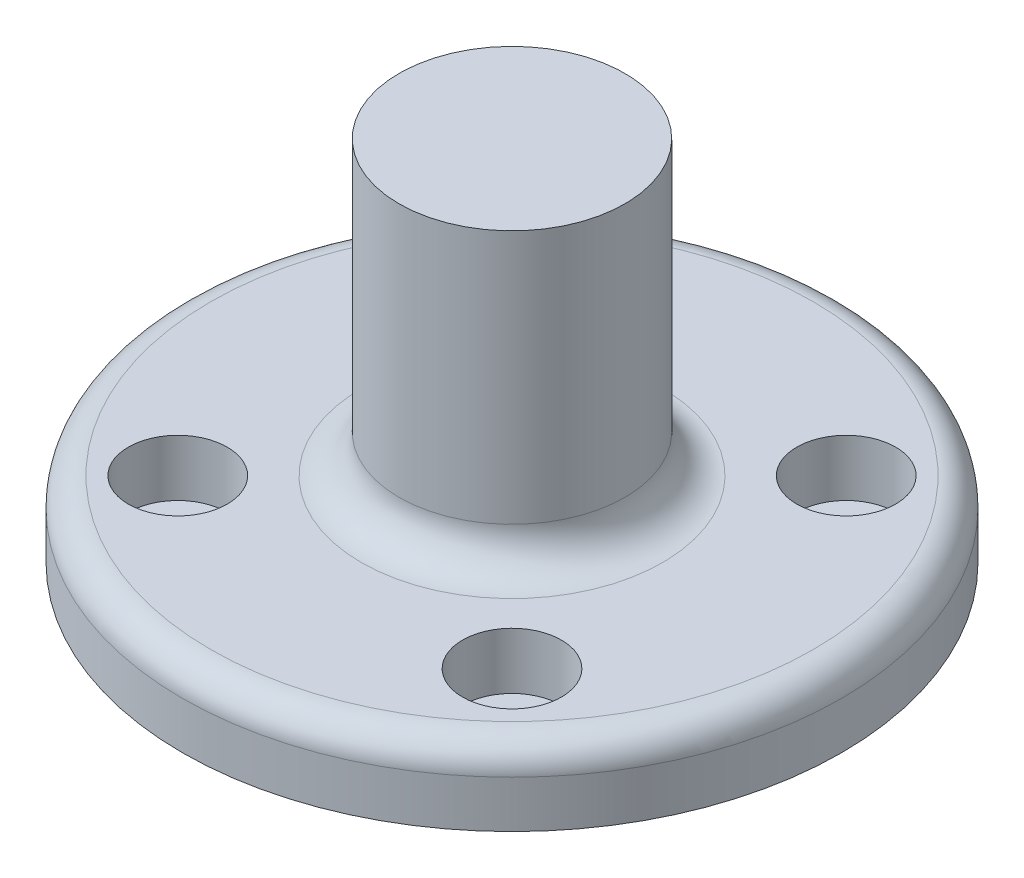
ISO-10303-21;
HEADER;
FILE_DESCRIPTION(('STEP AP214'),'2;1');
FILE_NAME('part.step','',(''),(''),'','','');
FILE_SCHEMA(('AUTOMOTIVE_DESIGN { 1 0 10303 214 1 1 1 1 }'));
ENDSEC;
DATA;
#1=APPLICATION_CONTEXT('core data for automotive mechanical design processes');
#2=APPLICATION_PROTOCOL_DEFINITION('international standard','automotive_design',2000,#1);
#3=PRODUCT_CONTEXT('',#1,'mechanical');
#4=PRODUCT('Part','Part','',(#3));
#5=PRODUCT_RELATED_PRODUCT_CATEGORY('part','',(#4));
#6=PRODUCT_DEFINITION_FORMATION('','',#4);
#7=PRODUCT_DEFINITION_CONTEXT('part definition',#1,'design');
#8=PRODUCT_DEFINITION('design','',#6,#7);
#9=PRODUCT_DEFINITION_SHAPE('','',#8);
#10=(LENGTH_UNIT() NAMED_UNIT(*) SI_UNIT(.MILLI.,.METRE.));
#11=(NAMED_UNIT(*) PLANE_ANGLE_UNIT() SI_UNIT($,.RADIAN.));
#12=(NAMED_UNIT(*) SI_UNIT($,.STERADIAN.) SOLID_ANGLE_UNIT());
#13=UNCERTAINTY_MEASURE_WITH_UNIT(LENGTH_MEASURE(1.E-05),#10,'distance_accuracy_value','');
#14=(GEOMETRIC_REPRESENTATION_CONTEXT(3) GLOBAL_UNCERTAINTY_ASSIGNED_CONTEXT((#13)) GLOBAL_UNIT_ASSIGNED_CONTEXT((#10,
#11,#12)) REPRESENTATION_CONTEXT('',''));
#15=CARTESIAN_POINT('',(0.,0.,0.));
#16=DIRECTION('',(0.,0.,1.));
#17=DIRECTION('',(1.,0.,0.));
#18=AXIS2_PLACEMENT_3D('',#15,#16,#17);
#19=CARTESIAN_POINT('',(0.,8.,0.));
#20=DIRECTION('',(0.,-1.,0.));
#21=DIRECTION('',(0.,0.,-1.));
#22=AXIS2_PLACEMENT_3D('',#19,#20,#21);
#23=CYLINDRICAL_SURFACE('',#22,35.);
#24=CARTESIAN_POINT('',(0.,5.,0.));
#25=DIRECTION('',(0.,1.,0.));
#26=DIRECTION('',(0.,0.,1.));
#27=AXIS2_PLACEMENT_3D('',#24,#25,#26);
#28=CIRCLE('',#27,35.);
#29=CARTESIAN_POINT('',(0.,5.,35.));
#30=VERTEX_POINT('',#29);
#31=EDGE_CURVE('E41',#30,#30,#28,.F.);
#32=ORIENTED_EDGE('',*,*,#31,.T.);
#33=EDGE_LOOP('',(#32));
#34=FACE_BOUND('',#33,.T.);
#35=CARTESIAN_POINT('',(0.,0.,0.));
#36=DIRECTION('',(0.,1.,0.));
#37=DIRECTION('',(0.,0.,1.));
#38=AXIS2_PLACEMENT_3D('',#35,#36,#37);
#39=CIRCLE('',#38,35.);
#40=CARTESIAN_POINT('',(0.,0.,35.));
#41=VERTEX_POINT('',#40);
#42=EDGE_CURVE('E50',#41,#41,#39,.T.);
#43=ORIENTED_EDGE('',*,*,#42,.T.);
#44=EDGE_LOOP('',(#43));
#45=FACE_BOUND('',#44,.T.);
#46=ADVANCED_FACE('F30',(#34,#45),#23,.T.);
#47=CARTESIAN_POINT('',(0.,8.,0.));
#48=DIRECTION('',(0.,1.,0.));
#49=DIRECTION('',(0.,0.,1.));
#50=AXIS2_PLACEMENT_3D('',#47,#48,#49);
#51=PLANE('',#50);
#52=CARTESIAN_POINT('',(0.,8.,0.));
#53=DIRECTION('',(0.,1.,0.));
#54=DIRECTION('',(0.,0.,1.));
#55=AXIS2_PLACEMENT_3D('',#52,#53,#54);
#56=CIRCLE('',#55,16.);
#57=CARTESIAN_POINT('',(0.,8.,16.));
#58=VERTEX_POINT('',#57);
#59=EDGE_CURVE('E10',#58,#58,#56,.F.);
#60=ORIENTED_EDGE('',*,*,#59,.T.);
#61=EDGE_LOOP('',(#60));
#62=FACE_BOUND('',#61,.T.);
#63=CARTESIAN_POINT('',(0.,8.,0.));
#64=DIRECTION('',(0.,1.,0.));
#65=DIRECTION('',(0.,0.,1.));
#66=AXIS2_PLACEMENT_3D('',#63,#64,#65);
#67=CIRCLE('',#66,32.);
#68=CARTESIAN_POINT('',(0.,8.,32.));
#69=VERTEX_POINT('',#68);
#70=EDGE_CURVE('E45',#69,#69,#67,.T.);
#71=ORIENTED_EDGE('',*,*,#70,.T.);
#72=EDGE_LOOP('',(#71));
#73=FACE_BOUND('',#72,.T.);
#74=CARTESIAN_POINT('',(-17.75,8.,17.75));
#75=DIRECTION('',(0.,1.,0.));
#76=DIRECTION('',(0.,0.,1.));
#77=AXIS2_PLACEMENT_3D('',#74,#75,#76);
#78=CIRCLE('',#77,5.25);
#79=CARTESIAN_POINT('',(-17.75,8.,23.));
#80=VERTEX_POINT('',#79);
#81=EDGE_CURVE('E72',#80,#80,#78,.T.);
#82=ORIENTED_EDGE('',*,*,#81,.F.);
#83=EDGE_LOOP('',(#82));
#84=FACE_BOUND('',#83,.T.);
#85=CARTESIAN_POINT('',(17.75,8.,17.75));
#86=DIRECTION('',(0.,1.,0.));
#87=DIRECTION('',(0.,0.,1.));
#88=AXIS2_PLACEMENT_3D('',#85,#86,#87);
#89=CIRCLE('',#88,5.25);
#90=CARTESIAN_POINT('',(17.75,8.,23.));
#91=VERTEX_POINT('',#90);
#92=EDGE_CURVE('E66',#91,#91,#89,.T.);
#93=ORIENTED_EDGE('',*,*,#92,.F.);
#94=EDGE_LOOP('',(#93));
#95=FACE_BOUND('',#94,.T.);
#96=CARTESIAN_POINT('',(17.75,8.,-17.75));
#97=DIRECTION('',(0.,1.,0.));
#98=DIRECTION('',(0.,0.,1.));
#99=AXIS2_PLACEMENT_3D('',#96,#97,#98);
#100=CIRCLE('',#99,5.25);
#101=CARTESIAN_POINT('',(17.75,8.,-12.5));
#102=VERTEX_POINT('',#101);
#103=EDGE_CURVE('E60',#102,#102,#100,.T.);
#104=ORIENTED_EDGE('',*,*,#103,.F.);
#105=EDGE_LOOP('',(#104));
#106=FACE_BOUND('',#105,.T.);
#107=CARTESIAN_POINT('',(-17.75,8.,-17.75));
#108=DIRECTION('',(0.,1.,0.));
#109=DIRECTION('',(0.,0.,1.));
#110=AXIS2_PLACEMENT_3D('',#107,#108,#109);
#111=CIRCLE('',#110,5.25);
#112=CARTESIAN_POINT('',(-17.75,8.,-12.5));
#113=VERTEX_POINT('',#112);
#114=EDGE_CURVE('E54',#113,#113,#111,.T.);
#115=ORIENTED_EDGE('',*,*,#114,.F.);
#116=EDGE_LOOP('',(#115));
#117=FACE_BOUND('',#116,.T.);
#118=ADVANCED_FACE('F121',(#62,#73,#84,#95,#106,#117),#51,.T.);
#119=CARTESIAN_POINT('',(0.,0.,0.));
#120=DIRECTION('',(0.,1.,0.));
#121=DIRECTION('',(0.,0.,1.));
#122=AXIS2_PLACEMENT_3D('',#119,#120,#121);
#123=PLANE('',#122);
#124=CARTESIAN_POINT('',(17.75,0.,17.75));
#125=DIRECTION('',(0.,1.,0.));
#126=DIRECTION('',(0.,0.,1.));
#127=AXIS2_PLACEMENT_3D('',#124,#125,#126);
#128=CIRCLE('',#127,3.25);
#129=CARTESIAN_POINT('',(17.75,0.,21.));
#130=VERTEX_POINT('',#129);
#131=EDGE_CURVE('E93',#130,#130,#128,.T.);
#132=ORIENTED_EDGE('',*,*,#131,.T.);
#133=EDGE_LOOP('',(#132));
#134=FACE_BOUND('',#133,.T.);
#135=CARTESIAN_POINT('',(-17.75,0.,17.75));
#136=DIRECTION('',(0.,1.,0.));
#137=DIRECTION('',(0.,0.,1.));
#138=AXIS2_PLACEMENT_3D('',#135,#136,#137);
#139=CIRCLE('',#138,3.25);
#140=CARTESIAN_POINT('',(-17.75,0.,21.));
#141=VERTEX_POINT('',#140);
#142=EDGE_CURVE('E87',#141,#141,#139,.T.);
#143=ORIENTED_EDGE('',*,*,#142,.T.);
#144=EDGE_LOOP('',(#143));
#145=FACE_BOUND('',#144,.T.);
#146=CARTESIAN_POINT('',(-17.75,0.,-17.75));
#147=DIRECTION('',(0.,1.,0.));
#148=DIRECTION('',(0.,0.,1.));
#149=AXIS2_PLACEMENT_3D('',#146,#147,#148);
#150=CIRCLE('',#149,3.25);
#151=CARTESIAN_POINT('',(-17.75,0.,-14.5));
#152=VERTEX_POINT('',#151);
#153=EDGE_CURVE('E81',#152,#152,#150,.T.);
#154=ORIENTED_EDGE('',*,*,#153,.T.);
#155=EDGE_LOOP('',(#154));
#156=FACE_BOUND('',#155,.T.);
#157=CARTESIAN_POINT('',(17.75,0.,-17.75));
#158=DIRECTION('',(0.,1.,0.));
#159=DIRECTION('',(0.,0.,1.));
#160=AXIS2_PLACEMENT_3D('',#157,#158,#159);
#161=CIRCLE('',#160,3.25);
#162=CARTESIAN_POINT('',(17.75,0.,-14.5));
#163=VERTEX_POINT('',#162);
#164=EDGE_CURVE('E75',#163,#163,#161,.T.);
#165=ORIENTED_EDGE('',*,*,#164,.T.);
#166=EDGE_LOOP('',(#165));
#167=FACE_BOUND('',#166,.T.);
#168=ORIENTED_EDGE('',*,*,#42,.F.);
#169=EDGE_LOOP('',(#168));
#170=FACE_BOUND('',#169,.T.);
#171=ADVANCED_FACE('F127',(#134,#145,#156,#167,#170),#123,.F.);
#172=CARTESIAN_POINT('',(-17.75,2.,-17.75));
#173=DIRECTION('',(0.,1.,0.));
#174=DIRECTION('',(0.,0.,1.));
#175=AXIS2_PLACEMENT_3D('',#172,#173,#174);
#176=CYLINDRICAL_SURFACE('',#175,5.25);
#177=CARTESIAN_POINT('',(-17.75,2.,-17.75));
#178=DIRECTION('',(0.,1.,0.));
#179=DIRECTION('',(0.,0.,1.));
#180=AXIS2_PLACEMENT_3D('',#177,#178,#179);
#181=CIRCLE('',#180,5.25);
#182=CARTESIAN_POINT('',(-17.75,2.,-12.5));
#183=VERTEX_POINT('',#182);
#184=EDGE_CURVE('E53',#183,#183,#181,.T.);
#185=ORIENTED_EDGE('',*,*,#184,.F.);
#186=EDGE_LOOP('',(#185));
#187=FACE_BOUND('',#186,.T.);
#188=ORIENTED_EDGE('',*,*,#114,.T.);
#189=EDGE_LOOP('',(#188));
#190=FACE_BOUND('',#189,.T.);
#191=ADVANCED_FACE('F150',(#187,#190),#176,.F.);
#192=CARTESIAN_POINT('',(-17.75,2.,-17.75));
#193=DIRECTION('',(0.,1.,0.));
#194=DIRECTION('',(0.,0.,1.));
#195=AXIS2_PLACEMENT_3D('',#192,#193,#194);
#196=PLANE('',#195);
#197=CARTESIAN_POINT('',(-17.75,2.,-17.75));
#198=DIRECTION('',(0.,1.,0.));
#199=DIRECTION('',(0.,0.,1.));
#200=AXIS2_PLACEMENT_3D('',#197,#198,#199);
#201=CIRCLE('',#200,3.25);
#202=CARTESIAN_POINT('',(-17.75,2.,-14.5));
#203=VERTEX_POINT('',#202);
#204=EDGE_CURVE('E84',#203,#203,#201,.T.);
#205=ORIENTED_EDGE('',*,*,#204,.F.);
#206=EDGE_LOOP('',(#205));
#207=FACE_BOUND('',#206,.T.);
#208=ORIENTED_EDGE('',*,*,#184,.T.);
#209=EDGE_LOOP('',(#208));
#210=FACE_BOUND('',#209,.T.);
#211=ADVANCED_FACE('F152',(#207,#210),#196,.T.);
#212=CARTESIAN_POINT('',(17.75,2.,-17.75));
#213=DIRECTION('',(0.,1.,0.));
#214=DIRECTION('',(0.,0.,1.));
#215=AXIS2_PLACEMENT_3D('',#212,#213,#214);
#216=CYLINDRICAL_SURFACE('',#215,5.25);
#217=CARTESIAN_POINT('',(17.75,2.,-17.75));
#218=DIRECTION('',(0.,1.,0.));
#219=DIRECTION('',(0.,0.,1.));
#220=AXIS2_PLACEMENT_3D('',#217,#218,#219);
#221=CIRCLE('',#220,5.25);
#222=CARTESIAN_POINT('',(17.75,2.,-12.5));
#223=VERTEX_POINT('',#222);
#224=EDGE_CURVE('E57',#223,#223,#221,.T.);
#225=ORIENTED_EDGE('',*,*,#224,.F.);
#226=EDGE_LOOP('',(#225));
#227=FACE_BOUND('',#226,.T.);
#228=ORIENTED_EDGE('',*,*,#103,.T.);
#229=EDGE_LOOP('',(#228));
#230=FACE_BOUND('',#229,.T.);
#231=ADVANCED_FACE('F159',(#227,#230),#216,.F.);
#232=CARTESIAN_POINT('',(17.75,2.,-17.75));
#233=DIRECTION('',(0.,1.,0.));
#234=DIRECTION('',(0.,0.,1.));
#235=AXIS2_PLACEMENT_3D('',#232,#233,#234);
#236=PLANE('',#235);
#237=CARTESIAN_POINT('',(17.75,2.,-17.75));
#238=DIRECTION('',(0.,1.,0.));
#239=DIRECTION('',(0.,0.,1.));
#240=AXIS2_PLACEMENT_3D('',#237,#238,#239);
#241=CIRCLE('',#240,3.25);
#242=CARTESIAN_POINT('',(17.75,2.,-14.5));
#243=VERTEX_POINT('',#242);
#244=EDGE_CURVE('E78',#243,#243,#241,.T.);
#245=ORIENTED_EDGE('',*,*,#244,.F.);
#246=EDGE_LOOP('',(#245));
#247=FACE_BOUND('',#246,.T.);
#248=ORIENTED_EDGE('',*,*,#224,.T.);
#249=EDGE_LOOP('',(#248));
#250=FACE_BOUND('',#249,.T.);
#251=ADVANCED_FACE('F167',(#247,#250),#236,.T.);
#252=CARTESIAN_POINT('',(17.75,2.,17.75));
#253=DIRECTION('',(0.,1.,0.));
#254=DIRECTION('',(0.,0.,1.));
#255=AXIS2_PLACEMENT_3D('',#252,#253,#254);
#256=CYLINDRICAL_SURFACE('',#255,5.25);
#257=CARTESIAN_POINT('',(17.75,2.,17.75));
#258=DIRECTION('',(0.,1.,0.));
#259=DIRECTION('',(0.,0.,1.));
#260=AXIS2_PLACEMENT_3D('',#257,#258,#259);
#261=CIRCLE('',#260,5.25);
#262=CARTESIAN_POINT('',(17.75,2.,23.));
#263=VERTEX_POINT('',#262);
#264=EDGE_CURVE('E63',#263,#263,#261,.T.);
#265=ORIENTED_EDGE('',*,*,#264,.F.);
#266=EDGE_LOOP('',(#265));
#267=FACE_BOUND('',#266,.T.);
#268=ORIENTED_EDGE('',*,*,#92,.T.);
#269=EDGE_LOOP('',(#268));
#270=FACE_BOUND('',#269,.T.);
#271=ADVANCED_FACE('F171',(#267,#270),#256,.F.);
#272=CARTESIAN_POINT('',(17.75,2.,17.75));
#273=DIRECTION('',(0.,1.,0.));
#274=DIRECTION('',(0.,0.,1.));
#275=AXIS2_PLACEMENT_3D('',#272,#273,#274);
#276=PLANE('',#275);
#277=CARTESIAN_POINT('',(17.75,2.,17.75));
#278=DIRECTION('',(0.,1.,0.));
#279=DIRECTION('',(0.,0.,1.));
#280=AXIS2_PLACEMENT_3D('',#277,#278,#279);
#281=CIRCLE('',#280,3.25);
#282=CARTESIAN_POINT('',(17.75,2.,21.));
#283=VERTEX_POINT('',#282);
#284=EDGE_CURVE('E96',#283,#283,#281,.T.);
#285=ORIENTED_EDGE('',*,*,#284,.F.);
#286=EDGE_LOOP('',(#285));
#287=FACE_BOUND('',#286,.T.);
#288=ORIENTED_EDGE('',*,*,#264,.T.);
#289=EDGE_LOOP('',(#288));
#290=FACE_BOUND('',#289,.T.);
#291=ADVANCED_FACE('F175',(#287,#290),#276,.T.);
#292=CARTESIAN_POINT('',(-17.75,2.,17.75));
#293=DIRECTION('',(0.,1.,0.));
#294=DIRECTION('',(0.,0.,1.));
#295=AXIS2_PLACEMENT_3D('',#292,#293,#294);
#296=CYLINDRICAL_SURFACE('',#295,5.25);
#297=CARTESIAN_POINT('',(-17.75,2.,17.75));
#298=DIRECTION('',(0.,1.,0.));
#299=DIRECTION('',(0.,0.,1.));
#300=AXIS2_PLACEMENT_3D('',#297,#298,#299);
#301=CIRCLE('',#300,5.25);
#302=CARTESIAN_POINT('',(-17.75,2.,23.));
#303=VERTEX_POINT('',#302);
#304=EDGE_CURVE('E69',#303,#303,#301,.T.);
#305=ORIENTED_EDGE('',*,*,#304,.F.);
#306=EDGE_LOOP('',(#305));
#307=FACE_BOUND('',#306,.T.);
#308=ORIENTED_EDGE('',*,*,#81,.T.);
#309=EDGE_LOOP('',(#308));
#310=FACE_BOUND('',#309,.T.);
#311=ADVANCED_FACE('F179',(#307,#310),#296,.F.);
#312=CARTESIAN_POINT('',(-17.75,2.,17.75));
#313=DIRECTION('',(0.,1.,0.));
#314=DIRECTION('',(0.,0.,1.));
#315=AXIS2_PLACEMENT_3D('',#312,#313,#314);
#316=PLANE('',#315);
#317=CARTESIAN_POINT('',(-17.75,2.,17.75));
#318=DIRECTION('',(0.,1.,0.));
#319=DIRECTION('',(0.,0.,1.));
#320=AXIS2_PLACEMENT_3D('',#317,#318,#319);
#321=CIRCLE('',#320,3.25);
#322=CARTESIAN_POINT('',(-17.75,2.,21.));
#323=VERTEX_POINT('',#322);
#324=EDGE_CURVE('E90',#323,#323,#321,.T.);
#325=ORIENTED_EDGE('',*,*,#324,.F.);
#326=EDGE_LOOP('',(#325));
#327=FACE_BOUND('',#326,.T.);
#328=ORIENTED_EDGE('',*,*,#304,.T.);
#329=EDGE_LOOP('',(#328));
#330=FACE_BOUND('',#329,.T.);
#331=ADVANCED_FACE('F183',(#327,#330),#316,.T.);
#332=CARTESIAN_POINT('',(17.75,0.,-17.75));
#333=DIRECTION('',(0.,1.,0.));
#334=DIRECTION('',(0.,0.,1.));
#335=AXIS2_PLACEMENT_3D('',#332,#333,#334);
#336=CYLINDRICAL_SURFACE('',#335,3.25);
#337=ORIENTED_EDGE('',*,*,#164,.F.);
#338=EDGE_LOOP('',(#337));
#339=FACE_BOUND('',#338,.T.);
#340=ORIENTED_EDGE('',*,*,#244,.T.);
#341=EDGE_LOOP('',(#340));
#342=FACE_BOUND('',#341,.T.);
#343=ADVANCED_FACE('F187',(#339,#342),#336,.F.);
#344=CARTESIAN_POINT('',(-17.75,0.,-17.75));
#345=DIRECTION('',(0.,1.,0.));
#346=DIRECTION('',(0.,0.,1.));
#347=AXIS2_PLACEMENT_3D('',#344,#345,#346);
#348=CYLINDRICAL_SURFACE('',#347,3.25);
#349=ORIENTED_EDGE('',*,*,#153,.F.);
#350=EDGE_LOOP('',(#349));
#351=FACE_BOUND('',#350,.T.);
#352=ORIENTED_EDGE('',*,*,#204,.T.);
#353=EDGE_LOOP('',(#352));
#354=FACE_BOUND('',#353,.T.);
#355=ADVANCED_FACE('F191',(#351,#354),#348,.F.);
#356=CARTESIAN_POINT('',(-17.75,0.,17.75));
#357=DIRECTION('',(0.,1.,0.));
#358=DIRECTION('',(0.,0.,1.));
#359=AXIS2_PLACEMENT_3D('',#356,#357,#358);
#360=CYLINDRICAL_SURFACE('',#359,3.25);
#361=ORIENTED_EDGE('',*,*,#142,.F.);
#362=EDGE_LOOP('',(#361));
#363=FACE_BOUND('',#362,.T.);
#364=ORIENTED_EDGE('',*,*,#324,.T.);
#365=EDGE_LOOP('',(#364));
#366=FACE_BOUND('',#365,.T.);
#367=ADVANCED_FACE('F117',(#363,#366),#360,.F.);
#368=CARTESIAN_POINT('',(17.75,0.,17.75));
#369=DIRECTION('',(0.,1.,0.));
#370=DIRECTION('',(0.,0.,1.));
#371=AXIS2_PLACEMENT_3D('',#368,#369,#370);
#372=CYLINDRICAL_SURFACE('',#371,3.25);
#373=ORIENTED_EDGE('',*,*,#131,.F.);
#374=EDGE_LOOP('',(#373));
#375=FACE_BOUND('',#374,.T.);
#376=ORIENTED_EDGE('',*,*,#284,.T.);
#377=EDGE_LOOP('',(#376));
#378=FACE_BOUND('',#377,.T.);
#379=ADVANCED_FACE('F109',(#375,#378),#372,.F.);
#380=CARTESIAN_POINT('',(0.,39.,0.));
#381=DIRECTION('',(0.,1.,0.));
#382=DIRECTION('',(0.,0.,1.));
#383=AXIS2_PLACEMENT_3D('',#380,#381,#382);
#384=CYLINDRICAL_SURFACE('',#383,12.);
#385=CARTESIAN_POINT('',(0.,12.,0.));
#386=DIRECTION('',(0.,1.,0.));
#387=DIRECTION('',(0.,0.,1.));
#388=AXIS2_PLACEMENT_3D('',#385,#386,#387);
#389=CIRCLE('',#388,12.);
#390=CARTESIAN_POINT('',(0.,12.,12.));
#391=VERTEX_POINT('',#390);
#392=EDGE_CURVE('E37',#391,#391,#389,.T.);
#393=ORIENTED_EDGE('',*,*,#392,.T.);
#394=EDGE_LOOP('',(#393));
#395=FACE_BOUND('',#394,.T.);
#396=CARTESIAN_POINT('',(0.,39.,0.));
#397=DIRECTION('',(0.,1.,0.));
#398=DIRECTION('',(0.,0.,1.));
#399=AXIS2_PLACEMENT_3D('',#396,#397,#398);
#400=CIRCLE('',#399,12.);
#401=CARTESIAN_POINT('',(0.,39.,12.));
#402=VERTEX_POINT('',#401);
#403=EDGE_CURVE('E99',#402,#402,#400,.T.);
#404=ORIENTED_EDGE('',*,*,#403,.F.);
#405=EDGE_LOOP('',(#404));
#406=FACE_BOUND('',#405,.T.);
#407=ADVANCED_FACE('F107',(#395,#406),#384,.T.);
#408=CARTESIAN_POINT('',(12.,39.,0.));
#409=DIRECTION('',(0.,-1.,0.));
#410=DIRECTION('',(0.,0.,-1.));
#411=AXIS2_PLACEMENT_3D('',#408,#409,#410);
#412=PLANE('',#411);
#413=ORIENTED_EDGE('',*,*,#403,.T.);
#414=EDGE_LOOP('',(#413));
#415=FACE_BOUND('',#414,.T.);
#416=ADVANCED_FACE('F105',(#415),#412,.F.);
#417=CARTESIAN_POINT('',(0.,5.,0.));
#418=DIRECTION('',(0.,1.,0.));
#419=DIRECTION('',(0.,0.,1.));
#420=AXIS2_PLACEMENT_3D('',#417,#418,#419);
#421=TOROIDAL_SURFACE('',#420,32.,3.);
#422=ORIENTED_EDGE('',*,*,#31,.F.);
#423=EDGE_LOOP('',(#422));
#424=FACE_BOUND('',#423,.T.);
#425=ORIENTED_EDGE('',*,*,#70,.F.);
#426=EDGE_LOOP('',(#425));
#427=FACE_BOUND('',#426,.T.);
#428=ADVANCED_FACE('F115',(#424,#427),#421,.T.);
#429=CARTESIAN_POINT('',(0.,12.,0.));
#430=DIRECTION('',(0.,1.,0.));
#431=DIRECTION('',(0.,0.,1.));
#432=AXIS2_PLACEMENT_3D('',#429,#430,#431);
#433=TOROIDAL_SURFACE('',#432,16.,4.);
#434=ORIENTED_EDGE('',*,*,#59,.F.);
#435=EDGE_LOOP('',(#434));
#436=FACE_BOUND('',#435,.T.);
#437=ORIENTED_EDGE('',*,*,#392,.F.);
#438=EDGE_LOOP('',(#437));
#439=FACE_BOUND('',#438,.T.);
#440=ADVANCED_FACE('F32',(#436,#439),#433,.F.);
#441=CLOSED_SHELL('',(#46,#118,#171,#191,#211,#231,#251,#271,#291,#311,#331,#343,#355,#367,#379,
#407,#416,#428,#440));
#442=MANIFOLD_SOLID_BREP('B2',#441);
#443=ADVANCED_BREP_SHAPE_REPRESENTATION('',(#18,#442),#14);
#444=SHAPE_DEFINITION_REPRESENTATION(#9,#443);
ENDSEC;
END-ISO-10303-21;
